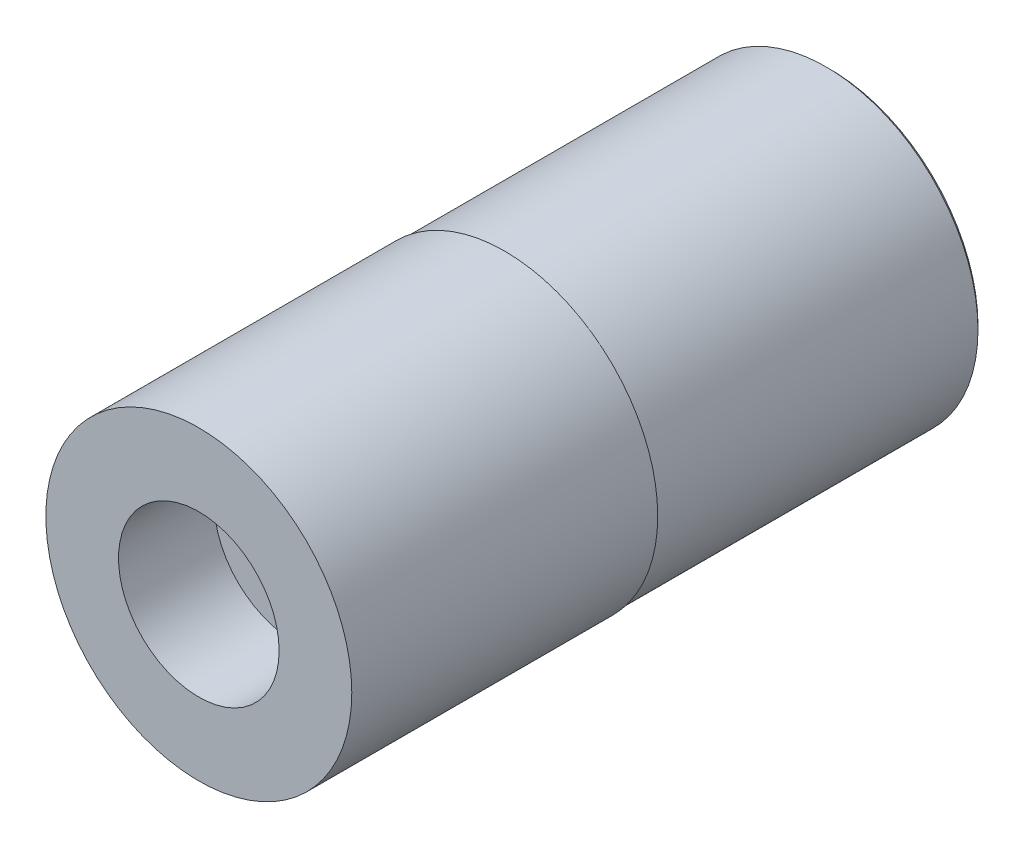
ISO-10303-21;
HEADER;
FILE_DESCRIPTION(('STEP AP214'),'2;1');
FILE_NAME('part.step','',(''),(''),'','','');
FILE_SCHEMA(('AUTOMOTIVE_DESIGN { 1 0 10303 214 1 1 1 1 }'));
ENDSEC;
DATA;
#1=APPLICATION_CONTEXT('core data for automotive mechanical design processes');
#2=APPLICATION_PROTOCOL_DEFINITION('international standard','automotive_design',2000,#1);
#3=PRODUCT_CONTEXT('',#1,'mechanical');
#4=PRODUCT('Part','Part','',(#3));
#5=PRODUCT_RELATED_PRODUCT_CATEGORY('part','',(#4));
#6=PRODUCT_DEFINITION_FORMATION('','',#4);
#7=PRODUCT_DEFINITION_CONTEXT('part definition',#1,'design');
#8=PRODUCT_DEFINITION('design','',#6,#7);
#9=PRODUCT_DEFINITION_SHAPE('','',#8);
#10=(LENGTH_UNIT() NAMED_UNIT(*) SI_UNIT(.MILLI.,.METRE.));
#11=(NAMED_UNIT(*) PLANE_ANGLE_UNIT() SI_UNIT($,.RADIAN.));
#12=(NAMED_UNIT(*) SI_UNIT($,.STERADIAN.) SOLID_ANGLE_UNIT());
#13=UNCERTAINTY_MEASURE_WITH_UNIT(LENGTH_MEASURE(1.E-05),#10,'distance_accuracy_value','');
#14=(GEOMETRIC_REPRESENTATION_CONTEXT(3) GLOBAL_UNCERTAINTY_ASSIGNED_CONTEXT((#13)) GLOBAL_UNIT_ASSIGNED_CONTEXT((#10,
#11,#12)) REPRESENTATION_CONTEXT('',''));
#15=CARTESIAN_POINT('',(0.,0.,0.));
#16=DIRECTION('',(0.,0.,1.));
#17=DIRECTION('',(1.,0.,0.));
#18=AXIS2_PLACEMENT_3D('',#15,#16,#17);
#19=CARTESIAN_POINT('',(0.,0.,3.79790950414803));
#20=DIRECTION('',(0.,0.,1.));
#21=DIRECTION('',(1.,0.,0.));
#22=AXIS2_PLACEMENT_3D('',#19,#20,#21);
#23=CYLINDRICAL_SURFACE('',#22,1.75);
#24=CARTESIAN_POINT('',(0.,0.,-25.));
#25=DIRECTION('',(0.,0.,1.));
#26=DIRECTION('',(1.,0.,0.));
#27=AXIS2_PLACEMENT_3D('',#24,#25,#26);
#28=CIRCLE('',#27,1.75);
#29=CARTESIAN_POINT('',(1.75,0.,-25.));
#30=VERTEX_POINT('',#29);
#31=EDGE_CURVE('E185',#30,#30,#28,.T.);
#32=ORIENTED_EDGE('',*,*,#31,.F.);
#33=EDGE_LOOP('',(#32));
#34=FACE_BOUND('',#33,.T.);
#35=CARTESIAN_POINT('',(0.,0.,-9.));
#36=DIRECTION('',(0.,0.,1.));
#37=DIRECTION('',(1.,0.,0.));
#38=AXIS2_PLACEMENT_3D('',#35,#36,#37);
#39=CIRCLE('',#38,1.75);
#40=CARTESIAN_POINT('',(1.51554445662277,-0.874999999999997,-9.));
#41=VERTEX_POINT('',#40);
#42=CARTESIAN_POINT('',(0.,-1.75,-9.));
#43=VERTEX_POINT('',#42);
#44=EDGE_CURVE('E11',#41,#43,#39,.F.);
#45=ORIENTED_EDGE('',*,*,#44,.F.);
#46=CARTESIAN_POINT('',(1.51554445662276,0.874999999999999,-9.));
#47=VERTEX_POINT('',#46);
#48=EDGE_CURVE('E38',#47,#41,#39,.F.);
#49=ORIENTED_EDGE('',*,*,#48,.F.);
#50=CARTESIAN_POINT('',(0.,1.75,-9.));
#51=VERTEX_POINT('',#50);
#52=EDGE_CURVE('E111',#51,#47,#39,.F.);
#53=ORIENTED_EDGE('',*,*,#52,.F.);
#54=CARTESIAN_POINT('',(-1.51554445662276,0.874999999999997,-9.));
#55=VERTEX_POINT('',#54);
#56=EDGE_CURVE('E296',#55,#51,#39,.F.);
#57=ORIENTED_EDGE('',*,*,#56,.F.);
#58=CARTESIAN_POINT('',(-1.51554445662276,-0.874999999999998,-9.));
#59=VERTEX_POINT('',#58);
#60=EDGE_CURVE('E294',#59,#55,#39,.F.);
#61=ORIENTED_EDGE('',*,*,#60,.F.);
#62=EDGE_CURVE('E43',#43,#59,#39,.F.);
#63=ORIENTED_EDGE('',*,*,#62,.F.);
#64=EDGE_LOOP('',(#45,#49,#53,#57,#61,#63));
#65=FACE_BOUND('',#64,.T.);
#66=ADVANCED_FACE('F34',(#34,#65),#23,.F.);
#67=CARTESIAN_POINT('',(0.,0.,3.79790950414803));
#68=DIRECTION('',(0.,0.,1.));
#69=DIRECTION('',(1.,0.,0.));
#70=AXIS2_PLACEMENT_3D('',#67,#68,#69);
#71=CYLINDRICAL_SURFACE('',#70,8.);
#72=CARTESIAN_POINT('',(0.,0.,0.));
#73=DIRECTION('',(0.,0.,1.));
#74=DIRECTION('',(1.,0.,0.));
#75=AXIS2_PLACEMENT_3D('',#72,#73,#74);
#76=CIRCLE('',#75,8.);
#77=CARTESIAN_POINT('',(8.,0.,0.));
#78=VERTEX_POINT('',#77);
#79=EDGE_CURVE('E194',#78,#78,#76,.T.);
#80=ORIENTED_EDGE('',*,*,#79,.F.);
#81=EDGE_LOOP('',(#80));
#82=FACE_BOUND('',#81,.T.);
#83=CARTESIAN_POINT('',(0.,0.,-16.));
#84=DIRECTION('',(0.,0.,-1.));
#85=DIRECTION('',(-1.,0.,0.));
#86=AXIS2_PLACEMENT_3D('',#83,#84,#85);
#87=CIRCLE('',#86,8.);
#88=CARTESIAN_POINT('',(-8.,0.,-16.));
#89=VERTEX_POINT('',#88);
#90=EDGE_CURVE('E179',#89,#89,#87,.T.);
#91=ORIENTED_EDGE('',*,*,#90,.F.);
#92=EDGE_LOOP('',(#91));
#93=FACE_BOUND('',#92,.T.);
#94=ADVANCED_FACE('F36',(#82,#93),#71,.T.);
#95=CARTESIAN_POINT('',(0.,0.,-33.));
#96=DIRECTION('',(0.,0.,1.));
#97=DIRECTION('',(1.,0.,0.));
#98=AXIS2_PLACEMENT_3D('',#95,#96,#97);
#99=CONICAL_SURFACE('',#98,7.7499999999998,0.785398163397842);
#100=CARTESIAN_POINT('',(0.,0.,-33.));
#101=DIRECTION('',(0.,0.,1.));
#102=DIRECTION('',(1.,0.,0.));
#103=AXIS2_PLACEMENT_3D('',#100,#101,#102);
#104=CIRCLE('',#103,7.7499999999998);
#105=CARTESIAN_POINT('',(7.7499999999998,0.,-33.));
#106=VERTEX_POINT('',#105);
#107=EDGE_CURVE('E175',#106,#106,#104,.T.);
#108=ORIENTED_EDGE('',*,*,#107,.T.);
#109=EDGE_LOOP('',(#108));
#110=FACE_BOUND('',#109,.T.);
#111=CARTESIAN_POINT('',(0.,0.,-32.815));
#112=DIRECTION('',(0.,0.,1.));
#113=DIRECTION('',(1.,0.,0.));
#114=AXIS2_PLACEMENT_3D('',#111,#112,#113);
#115=CIRCLE('',#114,7.935);
#116=CARTESIAN_POINT('',(7.935,0.,-32.815));
#117=VERTEX_POINT('',#116);
#118=EDGE_CURVE('E174',#117,#117,#115,.T.);
#119=ORIENTED_EDGE('',*,*,#118,.F.);
#120=EDGE_LOOP('',(#119));
#121=FACE_BOUND('',#120,.T.);
#122=ADVANCED_FACE('F204',(#110,#121),#99,.T.);
#123=CARTESIAN_POINT('',(0.,8.,0.));
#124=DIRECTION('',(0.,0.,-1.));
#125=DIRECTION('',(-1.,0.,0.));
#126=AXIS2_PLACEMENT_3D('',#123,#124,#125);
#127=PLANE('',#126);
#128=CARTESIAN_POINT('',(0.,0.,0.));
#129=DIRECTION('',(0.,0.,1.));
#130=DIRECTION('',(1.,0.,0.));
#131=AXIS2_PLACEMENT_3D('',#128,#129,#130);
#132=CIRCLE('',#131,4.2);
#133=CARTESIAN_POINT('',(4.2,0.,0.));
#134=VERTEX_POINT('',#133);
#135=EDGE_CURVE('E191',#134,#134,#132,.T.);
#136=ORIENTED_EDGE('',*,*,#135,.F.);
#137=EDGE_LOOP('',(#136));
#138=FACE_BOUND('',#137,.T.);
#139=ORIENTED_EDGE('',*,*,#79,.T.);
#140=EDGE_LOOP('',(#139));
#141=FACE_BOUND('',#140,.T.);
#142=ADVANCED_FACE('F210',(#138,#141),#127,.F.);
#143=CARTESIAN_POINT('',(0.,0.,3.79790950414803));
#144=DIRECTION('',(0.,0.,1.));
#145=DIRECTION('',(1.,0.,0.));
#146=AXIS2_PLACEMENT_3D('',#143,#144,#145);
#147=CYLINDRICAL_SURFACE('',#146,4.2);
#148=CARTESIAN_POINT('',(0.,0.,-5.));
#149=DIRECTION('',(0.,0.,1.));
#150=DIRECTION('',(1.,0.,0.));
#151=AXIS2_PLACEMENT_3D('',#148,#149,#150);
#152=CIRCLE('',#151,4.2);
#153=CARTESIAN_POINT('',(4.2,0.,-5.));
#154=VERTEX_POINT('',#153);
#155=EDGE_CURVE('E188',#154,#154,#152,.T.);
#156=ORIENTED_EDGE('',*,*,#155,.F.);
#157=EDGE_LOOP('',(#156));
#158=FACE_BOUND('',#157,.T.);
#159=ORIENTED_EDGE('',*,*,#135,.T.);
#160=EDGE_LOOP('',(#159));
#161=FACE_BOUND('',#160,.T.);
#162=ADVANCED_FACE('F218',(#158,#161),#147,.F.);
#163=CARTESIAN_POINT('',(0.,4.2,-5.));
#164=DIRECTION('',(0.,0.,-1.));
#165=DIRECTION('',(-1.,0.,0.));
#166=AXIS2_PLACEMENT_3D('',#163,#164,#165);
#167=PLANE('',#166);
#168=DIRECTION('',(-1.,0.,0.));
#169=VECTOR('',#168,1.);
#170=CARTESIAN_POINT('',(1.01036297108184,1.75,-5.));
#171=LINE('',#170,#169);
#172=CARTESIAN_POINT('',(1.01036297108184,1.75,-5.));
#173=VERTEX_POINT('',#172);
#174=CARTESIAN_POINT('',(-1.01036297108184,1.75,-5.));
#175=VERTEX_POINT('',#174);
#176=EDGE_CURVE('E50',#173,#175,#171,.T.);
#177=ORIENTED_EDGE('',*,*,#176,.F.);
#178=DIRECTION('',(-0.5,0.866025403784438,0.));
#179=VECTOR('',#178,1.);
#180=CARTESIAN_POINT('',(2.02072594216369,0.,-5.));
#181=LINE('',#180,#179);
#182=CARTESIAN_POINT('',(2.02072594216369,0.,-5.));
#183=VERTEX_POINT('',#182);
#184=EDGE_CURVE('E120',#183,#173,#181,.T.);
#185=ORIENTED_EDGE('',*,*,#184,.F.);
#186=DIRECTION('',(0.499999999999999,0.866025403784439,0.));
#187=VECTOR('',#186,1.);
#188=CARTESIAN_POINT('',(1.01036297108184,-1.75,-5.));
#189=LINE('',#188,#187);
#190=CARTESIAN_POINT('',(1.01036297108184,-1.75,-5.));
#191=VERTEX_POINT('',#190);
#192=EDGE_CURVE('E114',#191,#183,#189,.T.);
#193=ORIENTED_EDGE('',*,*,#192,.F.);
#194=DIRECTION('',(1.,0.,0.));
#195=VECTOR('',#194,1.);
#196=CARTESIAN_POINT('',(-1.01036297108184,-1.75,-5.));
#197=LINE('',#196,#195);
#198=CARTESIAN_POINT('',(-1.01036297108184,-1.75,-5.));
#199=VERTEX_POINT('',#198);
#200=EDGE_CURVE('E154',#199,#191,#197,.T.);
#201=ORIENTED_EDGE('',*,*,#200,.F.);
#202=DIRECTION('',(0.5,-0.866025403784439,0.));
#203=VECTOR('',#202,1.);
#204=CARTESIAN_POINT('',(-2.02072594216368,0.,-5.));
#205=LINE('',#204,#203);
#206=CARTESIAN_POINT('',(-2.02072594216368,0.,-5.));
#207=VERTEX_POINT('',#206);
#208=EDGE_CURVE('E151',#207,#199,#205,.T.);
#209=ORIENTED_EDGE('',*,*,#208,.F.);
#210=DIRECTION('',(-0.499999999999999,-0.866025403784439,0.));
#211=VECTOR('',#210,1.);
#212=CARTESIAN_POINT('',(-1.01036297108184,1.75,-5.));
#213=LINE('',#212,#211);
#214=EDGE_CURVE('E148',#175,#207,#213,.T.);
#215=ORIENTED_EDGE('',*,*,#214,.F.);
#216=EDGE_LOOP('',(#177,#185,#193,#201,#209,#215));
#217=FACE_BOUND('',#216,.T.);
#218=ORIENTED_EDGE('',*,*,#155,.T.);
#219=EDGE_LOOP('',(#218));
#220=FACE_BOUND('',#219,.T.);
#221=ADVANCED_FACE('F223',(#217,#220),#167,.F.);
#222=CARTESIAN_POINT('',(0.,1.75,-25.));
#223=DIRECTION('',(0.,0.,1.));
#224=DIRECTION('',(1.,0.,0.));
#225=AXIS2_PLACEMENT_3D('',#222,#223,#224);
#226=PLANE('',#225);
#227=CARTESIAN_POINT('',(0.,0.,-25.));
#228=DIRECTION('',(0.,0.,1.));
#229=DIRECTION('',(1.,0.,0.));
#230=AXIS2_PLACEMENT_3D('',#227,#228,#229);
#231=CIRCLE('',#230,4.);
#232=CARTESIAN_POINT('',(4.,0.,-25.));
#233=VERTEX_POINT('',#232);
#234=EDGE_CURVE('E182',#233,#233,#231,.T.);
#235=ORIENTED_EDGE('',*,*,#234,.F.);
#236=EDGE_LOOP('',(#235));
#237=FACE_BOUND('',#236,.T.);
#238=ORIENTED_EDGE('',*,*,#31,.T.);
#239=EDGE_LOOP('',(#238));
#240=FACE_BOUND('',#239,.T.);
#241=ADVANCED_FACE('F229',(#237,#240),#226,.F.);
#242=CARTESIAN_POINT('',(0.,0.,3.79790950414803));
#243=DIRECTION('',(0.,0.,1.));
#244=DIRECTION('',(1.,0.,0.));
#245=AXIS2_PLACEMENT_3D('',#242,#243,#244);
#246=CYLINDRICAL_SURFACE('',#245,4.);
#247=CARTESIAN_POINT('',(0.,0.,-33.));
#248=DIRECTION('',(0.,0.,1.));
#249=DIRECTION('',(1.,0.,0.));
#250=AXIS2_PLACEMENT_3D('',#247,#248,#249);
#251=CIRCLE('',#250,4.);
#252=CARTESIAN_POINT('',(4.,0.,-33.));
#253=VERTEX_POINT('',#252);
#254=EDGE_CURVE('E178',#253,#253,#251,.T.);
#255=ORIENTED_EDGE('',*,*,#254,.F.);
#256=EDGE_LOOP('',(#255));
#257=FACE_BOUND('',#256,.T.);
#258=ORIENTED_EDGE('',*,*,#234,.T.);
#259=EDGE_LOOP('',(#258));
#260=FACE_BOUND('',#259,.T.);
#261=ADVANCED_FACE('F233',(#257,#260),#246,.F.);
#262=CARTESIAN_POINT('',(0.,4.,-33.));
#263=DIRECTION('',(0.,0.,1.));
#264=DIRECTION('',(1.,0.,0.));
#265=AXIS2_PLACEMENT_3D('',#262,#263,#264);
#266=PLANE('',#265);
#267=ORIENTED_EDGE('',*,*,#107,.F.);
#268=EDGE_LOOP('',(#267));
#269=FACE_BOUND('',#268,.T.);
#270=ORIENTED_EDGE('',*,*,#254,.T.);
#271=EDGE_LOOP('',(#270));
#272=FACE_BOUND('',#271,.T.);
#273=ADVANCED_FACE('F237',(#269,#272),#266,.F.);
#274=CARTESIAN_POINT('',(0.,8.935,-16.));
#275=DIRECTION('',(0.,0.,-1.));
#276=DIRECTION('',(-1.,0.,0.));
#277=AXIS2_PLACEMENT_3D('',#274,#275,#276);
#278=PLANE('',#277);
#279=CARTESIAN_POINT('',(0.,0.,-16.));
#280=DIRECTION('',(0.,0.,1.));
#281=DIRECTION('',(1.,0.,0.));
#282=AXIS2_PLACEMENT_3D('',#279,#280,#281);
#283=CIRCLE('',#282,7.935);
#284=CARTESIAN_POINT('',(7.935,0.,-16.));
#285=VERTEX_POINT('',#284);
#286=EDGE_CURVE('E160',#285,#285,#283,.T.);
#287=ORIENTED_EDGE('',*,*,#286,.T.);
#288=EDGE_LOOP('',(#287));
#289=FACE_BOUND('',#288,.T.);
#290=ORIENTED_EDGE('',*,*,#90,.T.);
#291=EDGE_LOOP('',(#290));
#292=FACE_BOUND('',#291,.T.);
#293=ADVANCED_FACE('F201',(#289,#292),#278,.T.);
#294=CARTESIAN_POINT('',(0.,0.,0.));
#295=DIRECTION('',(0.,0.,1.));
#296=DIRECTION('',(1.,0.,0.));
#297=AXIS2_PLACEMENT_3D('',#294,#295,#296);
#298=CYLINDRICAL_SURFACE('',#297,7.935);
#299=ORIENTED_EDGE('',*,*,#286,.F.);
#300=EDGE_LOOP('',(#299));
#301=FACE_BOUND('',#300,.T.);
#302=ORIENTED_EDGE('',*,*,#118,.T.);
#303=EDGE_LOOP('',(#302));
#304=FACE_BOUND('',#303,.T.);
#305=ADVANCED_FACE('F244',(#301,#304),#298,.T.);
#306=CARTESIAN_POINT('',(2.02072594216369,0.,-9.));
#307=DIRECTION('',(0.866025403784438,0.5,0.));
#308=DIRECTION('',(-0.5,0.866025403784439,0.));
#309=AXIS2_PLACEMENT_3D('',#306,#307,#308);
#310=PLANE('',#309);
#311=ORIENTED_EDGE('',*,*,#184,.T.);
#312=DIRECTION('',(0.,0.,1.));
#313=VECTOR('',#312,1.);
#314=CARTESIAN_POINT('',(1.01036297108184,1.75,-9.));
#315=LINE('',#314,#313);
#316=CARTESIAN_POINT('',(1.01036297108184,1.75,-9.));
#317=VERTEX_POINT('',#316);
#318=EDGE_CURVE('E117',#317,#173,#315,.T.);
#319=ORIENTED_EDGE('',*,*,#318,.F.);
#320=DIRECTION('',(-0.5,0.866025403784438,0.));
#321=VECTOR('',#320,1.);
#322=CARTESIAN_POINT('',(2.02072594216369,0.,-9.));
#323=LINE('',#322,#321);
#324=EDGE_CURVE('E105',#47,#317,#323,.T.);
#325=ORIENTED_EDGE('',*,*,#324,.F.);
#326=CARTESIAN_POINT('',(2.02072594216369,0.,-9.));
#327=VERTEX_POINT('',#326);
#328=EDGE_CURVE('E58',#327,#47,#323,.T.);
#329=ORIENTED_EDGE('',*,*,#328,.F.);
#330=DIRECTION('',(0.,0.,1.));
#331=VECTOR('',#330,1.);
#332=CARTESIAN_POINT('',(2.02072594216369,0.,-9.));
#333=LINE('',#332,#331);
#334=EDGE_CURVE('E158',#327,#183,#333,.T.);
#335=ORIENTED_EDGE('',*,*,#334,.T.);
#336=EDGE_LOOP('',(#311,#319,#325,#329,#335));
#337=FACE_BOUND('',#336,.T.);
#338=ADVANCED_FACE('F118',(#337),#310,.F.);
#339=CARTESIAN_POINT('',(1.01036297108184,-1.75,-9.));
#340=DIRECTION('',(0.866025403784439,-0.5,0.));
#341=DIRECTION('',(0.5,0.866025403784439,0.));
#342=AXIS2_PLACEMENT_3D('',#339,#340,#341);
#343=PLANE('',#342);
#344=ORIENTED_EDGE('',*,*,#192,.T.);
#345=ORIENTED_EDGE('',*,*,#334,.F.);
#346=DIRECTION('',(0.499999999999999,0.866025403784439,0.));
#347=VECTOR('',#346,1.);
#348=CARTESIAN_POINT('',(1.01036297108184,-1.75,-9.));
#349=LINE('',#348,#347);
#350=EDGE_CURVE('E143',#41,#327,#349,.T.);
#351=ORIENTED_EDGE('',*,*,#350,.F.);
#352=CARTESIAN_POINT('',(1.01036297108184,-1.75,-9.));
#353=VERTEX_POINT('',#352);
#354=EDGE_CURVE('E123',#353,#41,#349,.T.);
#355=ORIENTED_EDGE('',*,*,#354,.F.);
#356=DIRECTION('',(0.,0.,1.));
#357=VECTOR('',#356,1.);
#358=CARTESIAN_POINT('',(1.01036297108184,-1.75,-9.));
#359=LINE('',#358,#357);
#360=EDGE_CURVE('E161',#353,#191,#359,.T.);
#361=ORIENTED_EDGE('',*,*,#360,.T.);
#362=EDGE_LOOP('',(#344,#345,#351,#355,#361));
#363=FACE_BOUND('',#362,.T.);
#364=ADVANCED_FACE('F251',(#363),#343,.F.);
#365=CARTESIAN_POINT('',(-1.01036297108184,-1.75,-9.));
#366=DIRECTION('',(0.,-1.,0.));
#367=DIRECTION('',(0.,0.,-1.));
#368=AXIS2_PLACEMENT_3D('',#365,#366,#367);
#369=PLANE('',#368);
#370=ORIENTED_EDGE('',*,*,#200,.T.);
#371=ORIENTED_EDGE('',*,*,#360,.F.);
#372=DIRECTION('',(1.,0.,0.));
#373=VECTOR('',#372,1.);
#374=CARTESIAN_POINT('',(-1.01036297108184,-1.75,-9.));
#375=LINE('',#374,#373);
#376=EDGE_CURVE('E139',#43,#353,#375,.T.);
#377=ORIENTED_EDGE('',*,*,#376,.F.);
#378=CARTESIAN_POINT('',(-1.01036297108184,-1.75,-9.));
#379=VERTEX_POINT('',#378);
#380=EDGE_CURVE('E140',#379,#43,#375,.T.);
#381=ORIENTED_EDGE('',*,*,#380,.F.);
#382=DIRECTION('',(0.,0.,1.));
#383=VECTOR('',#382,1.);
#384=CARTESIAN_POINT('',(-1.01036297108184,-1.75,-9.));
#385=LINE('',#384,#383);
#386=EDGE_CURVE('E164',#379,#199,#385,.T.);
#387=ORIENTED_EDGE('',*,*,#386,.T.);
#388=EDGE_LOOP('',(#370,#371,#377,#381,#387));
#389=FACE_BOUND('',#388,.T.);
#390=ADVANCED_FACE('F262',(#389),#369,.F.);
#391=CARTESIAN_POINT('',(-2.02072594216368,0.,-9.));
#392=DIRECTION('',(-0.866025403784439,-0.5,0.));
#393=DIRECTION('',(0.5,-0.866025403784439,0.));
#394=AXIS2_PLACEMENT_3D('',#391,#392,#393);
#395=PLANE('',#394);
#396=ORIENTED_EDGE('',*,*,#208,.T.);
#397=ORIENTED_EDGE('',*,*,#386,.F.);
#398=DIRECTION('',(0.5,-0.866025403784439,0.));
#399=VECTOR('',#398,1.);
#400=CARTESIAN_POINT('',(-2.02072594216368,0.,-9.));
#401=LINE('',#400,#399);
#402=EDGE_CURVE('E135',#59,#379,#401,.T.);
#403=ORIENTED_EDGE('',*,*,#402,.F.);
#404=CARTESIAN_POINT('',(-2.02072594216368,0.,-9.));
#405=VERTEX_POINT('',#404);
#406=EDGE_CURVE('E136',#405,#59,#401,.T.);
#407=ORIENTED_EDGE('',*,*,#406,.F.);
#408=DIRECTION('',(0.,0.,1.));
#409=VECTOR('',#408,1.);
#410=CARTESIAN_POINT('',(-2.02072594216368,0.,-9.));
#411=LINE('',#410,#409);
#412=EDGE_CURVE('E167',#405,#207,#411,.T.);
#413=ORIENTED_EDGE('',*,*,#412,.T.);
#414=EDGE_LOOP('',(#396,#397,#403,#407,#413));
#415=FACE_BOUND('',#414,.T.);
#416=ADVANCED_FACE('F258',(#415),#395,.F.);
#417=CARTESIAN_POINT('',(-1.01036297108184,1.75,-9.));
#418=DIRECTION('',(-0.866025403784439,0.5,0.));
#419=DIRECTION('',(-0.5,-0.866025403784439,0.));
#420=AXIS2_PLACEMENT_3D('',#417,#418,#419);
#421=PLANE('',#420);
#422=ORIENTED_EDGE('',*,*,#214,.T.);
#423=ORIENTED_EDGE('',*,*,#412,.F.);
#424=DIRECTION('',(-0.499999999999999,-0.866025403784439,0.));
#425=VECTOR('',#424,1.);
#426=CARTESIAN_POINT('',(-1.01036297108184,1.75,-9.));
#427=LINE('',#426,#425);
#428=EDGE_CURVE('E129',#55,#405,#427,.T.);
#429=ORIENTED_EDGE('',*,*,#428,.F.);
#430=CARTESIAN_POINT('',(-1.01036297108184,1.75,-9.));
#431=VERTEX_POINT('',#430);
#432=EDGE_CURVE('E131',#431,#55,#427,.T.);
#433=ORIENTED_EDGE('',*,*,#432,.F.);
#434=DIRECTION('',(0.,0.,1.));
#435=VECTOR('',#434,1.);
#436=CARTESIAN_POINT('',(-1.01036297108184,1.75,-9.));
#437=LINE('',#436,#435);
#438=EDGE_CURVE('E122',#431,#175,#437,.T.);
#439=ORIENTED_EDGE('',*,*,#438,.T.);
#440=EDGE_LOOP('',(#422,#423,#429,#433,#439));
#441=FACE_BOUND('',#440,.T.);
#442=ADVANCED_FACE('F255',(#441),#421,.F.);
#443=CARTESIAN_POINT('',(1.01036297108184,1.75,-9.));
#444=DIRECTION('',(0.,1.,0.));
#445=DIRECTION('',(-1.,0.,0.));
#446=AXIS2_PLACEMENT_3D('',#443,#444,#445);
#447=PLANE('',#446);
#448=ORIENTED_EDGE('',*,*,#176,.T.);
#449=ORIENTED_EDGE('',*,*,#438,.F.);
#450=DIRECTION('',(-1.,0.,0.));
#451=VECTOR('',#450,1.);
#452=CARTESIAN_POINT('',(1.01036297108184,1.75,-9.));
#453=LINE('',#452,#451);
#454=EDGE_CURVE('E128',#51,#431,#453,.T.);
#455=ORIENTED_EDGE('',*,*,#454,.F.);
#456=EDGE_CURVE('E109',#317,#51,#453,.T.);
#457=ORIENTED_EDGE('',*,*,#456,.F.);
#458=ORIENTED_EDGE('',*,*,#318,.T.);
#459=EDGE_LOOP('',(#448,#449,#455,#457,#458));
#460=FACE_BOUND('',#459,.T.);
#461=ADVANCED_FACE('F126',(#460),#447,.F.);
#462=CARTESIAN_POINT('',(1.01036297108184,1.75,-9.));
#463=DIRECTION('',(0.,0.,1.));
#464=DIRECTION('',(1.,0.,0.));
#465=AXIS2_PLACEMENT_3D('',#462,#463,#464);
#466=PLANE('',#465);
#467=ORIENTED_EDGE('',*,*,#44,.T.);
#468=ORIENTED_EDGE('',*,*,#376,.T.);
#469=ORIENTED_EDGE('',*,*,#354,.T.);
#470=EDGE_LOOP('',(#467,#468,#469));
#471=FACE_BOUND('',#470,.T.);
#472=ADVANCED_FACE('F254',(#471),#466,.T.);
#473=ORIENTED_EDGE('',*,*,#62,.T.);
#474=ORIENTED_EDGE('',*,*,#402,.T.);
#475=ORIENTED_EDGE('',*,*,#380,.T.);
#476=EDGE_LOOP('',(#473,#474,#475));
#477=FACE_BOUND('',#476,.T.);
#478=ADVANCED_FACE('F271',(#477),#466,.T.);
#479=ORIENTED_EDGE('',*,*,#60,.T.);
#480=ORIENTED_EDGE('',*,*,#428,.T.);
#481=ORIENTED_EDGE('',*,*,#406,.T.);
#482=EDGE_LOOP('',(#479,#480,#481));
#483=FACE_BOUND('',#482,.T.);
#484=ADVANCED_FACE('F277',(#483),#466,.T.);
#485=ORIENTED_EDGE('',*,*,#56,.T.);
#486=ORIENTED_EDGE('',*,*,#454,.T.);
#487=ORIENTED_EDGE('',*,*,#432,.T.);
#488=EDGE_LOOP('',(#485,#486,#487));
#489=FACE_BOUND('',#488,.T.);
#490=ADVANCED_FACE('F283',(#489),#466,.T.);
#491=ORIENTED_EDGE('',*,*,#52,.T.);
#492=ORIENTED_EDGE('',*,*,#324,.T.);
#493=ORIENTED_EDGE('',*,*,#456,.T.);
#494=EDGE_LOOP('',(#491,#492,#493));
#495=FACE_BOUND('',#494,.T.);
#496=ADVANCED_FACE('F107',(#495),#466,.T.);
#497=ORIENTED_EDGE('',*,*,#48,.T.);
#498=ORIENTED_EDGE('',*,*,#350,.T.);
#499=ORIENTED_EDGE('',*,*,#328,.T.);
#500=EDGE_LOOP('',(#497,#498,#499));
#501=FACE_BOUND('',#500,.T.);
#502=ADVANCED_FACE('F273',(#501),#466,.T.);
#503=CLOSED_SHELL('',(#66,#94,#122,#142,#162,#221,#241,#261,#273,#293,#305,#338,#364,#390,#416,
#442,#461,#472,#478,#484,#490,#496,#502));
#504=MANIFOLD_SOLID_BREP('B2',#503);
#505=ADVANCED_BREP_SHAPE_REPRESENTATION('',(#18,#504),#14);
#506=SHAPE_DEFINITION_REPRESENTATION(#9,#505);
ENDSEC;
END-ISO-10303-21;
